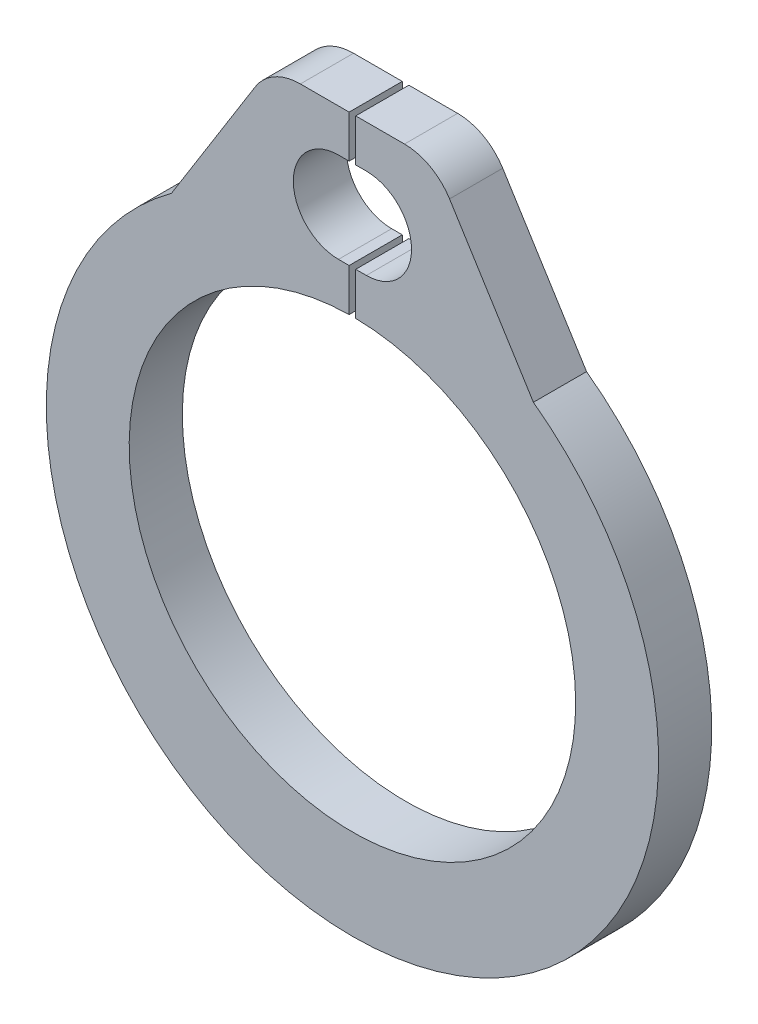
ISO-10303-21;
HEADER;
FILE_DESCRIPTION(('STEP AP214'),'2;1');
FILE_NAME('part.step','',(''),(''),'','','');
FILE_SCHEMA(('AUTOMOTIVE_DESIGN { 1 0 10303 214 1 1 1 1 }'));
ENDSEC;
DATA;
#1=APPLICATION_CONTEXT('core data for automotive mechanical design processes');
#2=APPLICATION_PROTOCOL_DEFINITION('international standard','automotive_design',2000,#1);
#3=PRODUCT_CONTEXT('',#1,'mechanical');
#4=PRODUCT('Part','Part','',(#3));
#5=PRODUCT_RELATED_PRODUCT_CATEGORY('part','',(#4));
#6=PRODUCT_DEFINITION_FORMATION('','',#4);
#7=PRODUCT_DEFINITION_CONTEXT('part definition',#1,'design');
#8=PRODUCT_DEFINITION('design','',#6,#7);
#9=PRODUCT_DEFINITION_SHAPE('','',#8);
#10=(LENGTH_UNIT() NAMED_UNIT(*) SI_UNIT(.MILLI.,.METRE.));
#11=(NAMED_UNIT(*) PLANE_ANGLE_UNIT() SI_UNIT($,.RADIAN.));
#12=(NAMED_UNIT(*) SI_UNIT($,.STERADIAN.) SOLID_ANGLE_UNIT());
#13=UNCERTAINTY_MEASURE_WITH_UNIT(LENGTH_MEASURE(1.E-05),#10,'distance_accuracy_value','');
#14=(GEOMETRIC_REPRESENTATION_CONTEXT(3) GLOBAL_UNCERTAINTY_ASSIGNED_CONTEXT((#13)) GLOBAL_UNIT_ASSIGNED_CONTEXT((#10,
#11,#12)) REPRESENTATION_CONTEXT('',''));
#15=CARTESIAN_POINT('',(0.,0.,0.));
#16=DIRECTION('',(0.,0.,1.));
#17=DIRECTION('',(1.,0.,0.));
#18=AXIS2_PLACEMENT_3D('',#15,#16,#17);
#19=CARTESIAN_POINT('',(-0.325900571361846,-0.0766161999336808,1.));
#20=DIRECTION('',(0.,0.,-1.));
#21=DIRECTION('',(-1.,0.,0.));
#22=AXIS2_PLACEMENT_3D('',#19,#20,#21);
#23=CYLINDRICAL_SURFACE('',#22,4.2);
#24=CARTESIAN_POINT('',(-0.325900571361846,-0.0766161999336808,0.));
#25=DIRECTION('',(0.,0.,1.));
#26=DIRECTION('',(1.,0.,0.));
#27=AXIS2_PLACEMENT_3D('',#24,#25,#26);
#28=CIRCLE('',#27,4.2);
#29=CARTESIAN_POINT('',(-0.387823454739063,4.1229272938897,0.));
#30=VERTEX_POINT('',#29);
#31=CARTESIAN_POINT('',(-0.263977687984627,4.1229272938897,0.));
#32=VERTEX_POINT('',#31);
#33=EDGE_CURVE('E195',#30,#32,#28,.T.);
#34=ORIENTED_EDGE('',*,*,#33,.F.);
#35=DIRECTION('',(0.,0.,-1.));
#36=VECTOR('',#35,1.);
#37=CARTESIAN_POINT('',(-0.387823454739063,4.1229272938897,1.));
#38=LINE('',#37,#36);
#39=CARTESIAN_POINT('',(-0.387823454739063,4.1229272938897,1.));
#40=VERTEX_POINT('',#39);
#41=EDGE_CURVE('E11',#40,#30,#38,.T.);
#42=ORIENTED_EDGE('',*,*,#41,.F.);
#43=CARTESIAN_POINT('',(-0.325900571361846,-0.0766161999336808,1.));
#44=DIRECTION('',(0.,0.,1.));
#45=DIRECTION('',(1.,0.,0.));
#46=AXIS2_PLACEMENT_3D('',#43,#44,#45);
#47=CIRCLE('',#46,4.2);
#48=CARTESIAN_POINT('',(-0.263977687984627,4.1229272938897,1.));
#49=VERTEX_POINT('',#48);
#50=EDGE_CURVE('E239',#40,#49,#47,.T.);
#51=ORIENTED_EDGE('',*,*,#50,.T.);
#52=DIRECTION('',(0.,0.,-1.));
#53=VECTOR('',#52,1.);
#54=CARTESIAN_POINT('',(-0.263977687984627,4.1229272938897,1.));
#55=LINE('',#54,#53);
#56=EDGE_CURVE('E41',#49,#32,#55,.T.);
#57=ORIENTED_EDGE('',*,*,#56,.T.);
#58=EDGE_LOOP('',(#34,#42,#51,#57));
#59=FACE_BOUND('',#58,.T.);
#60=ADVANCED_FACE('F38',(#59),#23,.F.);
#61=CARTESIAN_POINT('',(-0.387823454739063,4.1229272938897,1.));
#62=DIRECTION('',(-1.,0.,0.));
#63=DIRECTION('',(0.,0.,1.));
#64=AXIS2_PLACEMENT_3D('',#61,#62,#63);
#65=PLANE('',#64);
#66=DIRECTION('',(0.,1.,0.));
#67=VECTOR('',#66,1.);
#68=CARTESIAN_POINT('',(-0.387823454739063,4.1229272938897,0.));
#69=LINE('',#68,#67);
#70=CARTESIAN_POINT('',(-0.387823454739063,4.92338380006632,0.));
#71=VERTEX_POINT('',#70);
#72=EDGE_CURVE('E238',#30,#71,#69,.T.);
#73=ORIENTED_EDGE('',*,*,#72,.T.);
#74=DIRECTION('',(0.,0.,-1.));
#75=VECTOR('',#74,1.);
#76=CARTESIAN_POINT('',(-0.387823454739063,4.92338380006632,1.));
#77=LINE('',#76,#75);
#78=CARTESIAN_POINT('',(-0.387823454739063,4.92338380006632,1.));
#79=VERTEX_POINT('',#78);
#80=EDGE_CURVE('E47',#79,#71,#77,.T.);
#81=ORIENTED_EDGE('',*,*,#80,.F.);
#82=DIRECTION('',(0.,1.,0.));
#83=VECTOR('',#82,1.);
#84=CARTESIAN_POINT('',(-0.387823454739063,4.1229272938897,1.));
#85=LINE('',#84,#83);
#86=EDGE_CURVE('E184',#40,#79,#85,.T.);
#87=ORIENTED_EDGE('',*,*,#86,.F.);
#88=ORIENTED_EDGE('',*,*,#41,.T.);
#89=EDGE_LOOP('',(#73,#81,#87,#88));
#90=FACE_BOUND('',#89,.T.);
#91=ADVANCED_FACE('F276',(#90),#65,.F.);
#92=CARTESIAN_POINT('',(-0.587823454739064,4.92338380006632,1.));
#93=DIRECTION('',(0.,1.,0.));
#94=DIRECTION('',(0.,0.,1.));
#95=AXIS2_PLACEMENT_3D('',#92,#93,#94);
#96=PLANE('',#95);
#97=DIRECTION('',(1.,0.,0.));
#98=VECTOR('',#97,1.);
#99=CARTESIAN_POINT('',(-0.587823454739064,4.92338380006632,0.));
#100=LINE('',#99,#98);
#101=CARTESIAN_POINT('',(-0.587823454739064,4.92338380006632,0.));
#102=VERTEX_POINT('',#101);
#103=EDGE_CURVE('E172',#102,#71,#100,.T.);
#104=ORIENTED_EDGE('',*,*,#103,.F.);
#105=DIRECTION('',(0.,0.,-1.));
#106=VECTOR('',#105,1.);
#107=CARTESIAN_POINT('',(-0.587823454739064,4.92338380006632,1.));
#108=LINE('',#107,#106);
#109=CARTESIAN_POINT('',(-0.587823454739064,4.92338380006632,1.));
#110=VERTEX_POINT('',#109);
#111=EDGE_CURVE('E167',#110,#102,#108,.T.);
#112=ORIENTED_EDGE('',*,*,#111,.F.);
#113=DIRECTION('',(1.,0.,0.));
#114=VECTOR('',#113,1.);
#115=CARTESIAN_POINT('',(-0.587823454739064,4.92338380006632,1.));
#116=LINE('',#115,#114);
#117=EDGE_CURVE('E170',#110,#79,#116,.T.);
#118=ORIENTED_EDGE('',*,*,#117,.T.);
#119=ORIENTED_EDGE('',*,*,#80,.T.);
#120=EDGE_LOOP('',(#104,#112,#118,#119));
#121=FACE_BOUND('',#120,.T.);
#122=ADVANCED_FACE('F169',(#121),#96,.T.);
#123=CARTESIAN_POINT('',(-0.587823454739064,5.77338380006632,1.));
#124=DIRECTION('',(0.,0.,-1.));
#125=DIRECTION('',(-1.,0.,0.));
#126=AXIS2_PLACEMENT_3D('',#123,#124,#125);
#127=CYLINDRICAL_SURFACE('',#126,0.85);
#128=CARTESIAN_POINT('',(-0.587823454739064,5.77338380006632,0.));
#129=DIRECTION('',(0.,0.,1.));
#130=DIRECTION('',(1.,0.,0.));
#131=AXIS2_PLACEMENT_3D('',#128,#129,#130);
#132=CIRCLE('',#131,0.85);
#133=CARTESIAN_POINT('',(-0.587823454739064,6.62338380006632,0.));
#134=VERTEX_POINT('',#133);
#135=EDGE_CURVE('E235',#134,#102,#132,.T.);
#136=ORIENTED_EDGE('',*,*,#135,.F.);
#137=DIRECTION('',(0.,0.,-1.));
#138=VECTOR('',#137,1.);
#139=CARTESIAN_POINT('',(-0.587823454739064,6.62338380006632,1.));
#140=LINE('',#139,#138);
#141=CARTESIAN_POINT('',(-0.587823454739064,6.62338380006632,1.));
#142=VERTEX_POINT('',#141);
#143=EDGE_CURVE('E177',#142,#134,#140,.T.);
#144=ORIENTED_EDGE('',*,*,#143,.F.);
#145=CARTESIAN_POINT('',(-0.587823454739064,5.77338380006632,1.));
#146=DIRECTION('',(0.,0.,1.));
#147=DIRECTION('',(1.,0.,0.));
#148=AXIS2_PLACEMENT_3D('',#145,#146,#147);
#149=CIRCLE('',#148,0.85);
#150=EDGE_CURVE('E183',#142,#110,#149,.T.);
#151=ORIENTED_EDGE('',*,*,#150,.T.);
#152=ORIENTED_EDGE('',*,*,#111,.T.);
#153=EDGE_LOOP('',(#136,#144,#151,#152));
#154=FACE_BOUND('',#153,.T.);
#155=ADVANCED_FACE('F186',(#154),#127,.F.);
#156=CARTESIAN_POINT('',(-0.587823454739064,6.62338380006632,1.));
#157=DIRECTION('',(0.,1.,0.));
#158=DIRECTION('',(0.,0.,1.));
#159=AXIS2_PLACEMENT_3D('',#156,#157,#158);
#160=PLANE('',#159);
#161=DIRECTION('',(1.,0.,0.));
#162=VECTOR('',#161,1.);
#163=CARTESIAN_POINT('',(-0.587823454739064,6.62338380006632,0.));
#164=LINE('',#163,#162);
#165=CARTESIAN_POINT('',(-0.387823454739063,6.62338380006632,0.));
#166=VERTEX_POINT('',#165);
#167=EDGE_CURVE('E233',#134,#166,#164,.T.);
#168=ORIENTED_EDGE('',*,*,#167,.T.);
#169=DIRECTION('',(0.,0.,-1.));
#170=VECTOR('',#169,1.);
#171=CARTESIAN_POINT('',(-0.387823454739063,6.62338380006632,1.));
#172=LINE('',#171,#170);
#173=CARTESIAN_POINT('',(-0.387823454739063,6.62338380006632,1.));
#174=VERTEX_POINT('',#173);
#175=EDGE_CURVE('E243',#174,#166,#172,.T.);
#176=ORIENTED_EDGE('',*,*,#175,.F.);
#177=DIRECTION('',(1.,0.,0.));
#178=VECTOR('',#177,1.);
#179=CARTESIAN_POINT('',(-0.587823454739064,6.62338380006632,1.));
#180=LINE('',#179,#178);
#181=EDGE_CURVE('E188',#142,#174,#180,.T.);
#182=ORIENTED_EDGE('',*,*,#181,.F.);
#183=ORIENTED_EDGE('',*,*,#143,.T.);
#184=EDGE_LOOP('',(#168,#176,#182,#183));
#185=FACE_BOUND('',#184,.T.);
#186=ADVANCED_FACE('F364',(#185),#160,.F.);
#187=CARTESIAN_POINT('',(-0.387823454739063,6.62338380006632,1.));
#188=DIRECTION('',(-1.,0.,0.));
#189=DIRECTION('',(0.,0.,1.));
#190=AXIS2_PLACEMENT_3D('',#187,#188,#189);
#191=PLANE('',#190);
#192=DIRECTION('',(0.,1.,0.));
#193=VECTOR('',#192,1.);
#194=CARTESIAN_POINT('',(-0.387823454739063,6.62338380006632,0.));
#195=LINE('',#194,#193);
#196=CARTESIAN_POINT('',(-0.387823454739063,7.4229272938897,0.));
#197=VERTEX_POINT('',#196);
#198=EDGE_CURVE('E230',#166,#197,#195,.T.);
#199=ORIENTED_EDGE('',*,*,#198,.T.);
#200=DIRECTION('',(0.,0.,-1.));
#201=VECTOR('',#200,1.);
#202=CARTESIAN_POINT('',(-0.387823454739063,7.4229272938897,1.));
#203=LINE('',#202,#201);
#204=CARTESIAN_POINT('',(-0.387823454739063,7.4229272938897,1.));
#205=VERTEX_POINT('',#204);
#206=EDGE_CURVE('E246',#205,#197,#203,.T.);
#207=ORIENTED_EDGE('',*,*,#206,.F.);
#208=DIRECTION('',(0.,1.,0.));
#209=VECTOR('',#208,1.);
#210=CARTESIAN_POINT('',(-0.387823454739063,6.62338380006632,1.));
#211=LINE('',#210,#209);
#212=EDGE_CURVE('E190',#174,#205,#211,.T.);
#213=ORIENTED_EDGE('',*,*,#212,.F.);
#214=ORIENTED_EDGE('',*,*,#175,.T.);
#215=EDGE_LOOP('',(#199,#207,#213,#214));
#216=FACE_BOUND('',#215,.T.);
#217=ADVANCED_FACE('F312',(#216),#191,.F.);
#218=CARTESIAN_POINT('',(-1.30524120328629,7.4229272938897,1.));
#219=DIRECTION('',(0.,1.,0.));
#220=DIRECTION('',(0.,0.,1.));
#221=AXIS2_PLACEMENT_3D('',#218,#219,#220);
#222=PLANE('',#221);
#223=DIRECTION('',(1.,0.,0.));
#224=VECTOR('',#223,1.);
#225=CARTESIAN_POINT('',(-1.30524120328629,7.4229272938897,0.));
#226=LINE('',#225,#224);
#227=CARTESIAN_POINT('',(-1.30524120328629,7.4229272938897,0.));
#228=VERTEX_POINT('',#227);
#229=EDGE_CURVE('E227',#228,#197,#226,.T.);
#230=ORIENTED_EDGE('',*,*,#229,.F.);
#231=DIRECTION('',(0.,0.,-1.));
#232=VECTOR('',#231,1.);
#233=CARTESIAN_POINT('',(-1.30524120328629,7.4229272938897,1.));
#234=LINE('',#233,#232);
#235=CARTESIAN_POINT('',(-1.30524120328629,7.4229272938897,1.));
#236=VERTEX_POINT('',#235);
#237=EDGE_CURVE('E248',#236,#228,#234,.T.);
#238=ORIENTED_EDGE('',*,*,#237,.F.);
#239=DIRECTION('',(1.,0.,0.));
#240=VECTOR('',#239,1.);
#241=CARTESIAN_POINT('',(-1.30524120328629,7.4229272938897,1.));
#242=LINE('',#241,#240);
#243=EDGE_CURVE('E305',#236,#205,#242,.T.);
#244=ORIENTED_EDGE('',*,*,#243,.T.);
#245=ORIENTED_EDGE('',*,*,#206,.T.);
#246=EDGE_LOOP('',(#230,#238,#244,#245));
#247=FACE_BOUND('',#246,.T.);
#248=ADVANCED_FACE('F316',(#247),#222,.T.);
#249=CARTESIAN_POINT('',(-1.3052412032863,6.4229272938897,1.));
#250=DIRECTION('',(0.,0.,-1.));
#251=DIRECTION('',(-1.,0.,0.));
#252=AXIS2_PLACEMENT_3D('',#249,#250,#251);
#253=CYLINDRICAL_SURFACE('',#252,1.);
#254=CARTESIAN_POINT('',(-1.3052412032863,6.4229272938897,0.));
#255=DIRECTION('',(0.,0.,1.));
#256=DIRECTION('',(1.,0.,0.));
#257=AXIS2_PLACEMENT_3D('',#254,#255,#256);
#258=CIRCLE('',#257,1.);
#259=CARTESIAN_POINT('',(-2.15328929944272,6.9528465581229,0.));
#260=VERTEX_POINT('',#259);
#261=EDGE_CURVE('E224',#228,#260,#258,.T.);
#262=ORIENTED_EDGE('',*,*,#261,.T.);
#263=DIRECTION('',(0.,0.,-1.));
#264=VECTOR('',#263,1.);
#265=CARTESIAN_POINT('',(-2.15328929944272,6.9528465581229,1.));
#266=LINE('',#265,#264);
#267=CARTESIAN_POINT('',(-2.15328929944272,6.9528465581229,1.));
#268=VERTEX_POINT('',#267);
#269=EDGE_CURVE('E250',#268,#260,#266,.T.);
#270=ORIENTED_EDGE('',*,*,#269,.F.);
#271=CARTESIAN_POINT('',(-1.3052412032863,6.4229272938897,1.));
#272=DIRECTION('',(0.,0.,1.));
#273=DIRECTION('',(1.,0.,0.));
#274=AXIS2_PLACEMENT_3D('',#271,#272,#273);
#275=CIRCLE('',#274,1.);
#276=EDGE_CURVE('E303',#236,#268,#275,.T.);
#277=ORIENTED_EDGE('',*,*,#276,.F.);
#278=ORIENTED_EDGE('',*,*,#237,.T.);
#279=EDGE_LOOP('',(#262,#270,#277,#278));
#280=FACE_BOUND('',#279,.T.);
#281=ADVANCED_FACE('F321',(#280),#253,.T.);
#282=CARTESIAN_POINT('',(-3.7309841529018,4.42800700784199,1.));
#283=DIRECTION('',(-0.848048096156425,0.529919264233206,0.));
#284=DIRECTION('',(-0.529919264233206,-0.848048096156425,0.));
#285=AXIS2_PLACEMENT_3D('',#282,#283,#284);
#286=PLANE('',#285);
#287=DIRECTION('',(0.529919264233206,0.848048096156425,0.));
#288=VECTOR('',#287,1.);
#289=CARTESIAN_POINT('',(-3.7309841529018,4.42800700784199,0.));
#290=LINE('',#289,#288);
#291=CARTESIAN_POINT('',(-3.7309841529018,4.42800700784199,0.));
#292=VERTEX_POINT('',#291);
#293=EDGE_CURVE('E221',#292,#260,#290,.T.);
#294=ORIENTED_EDGE('',*,*,#293,.F.);
#295=DIRECTION('',(0.,0.,-1.));
#296=VECTOR('',#295,1.);
#297=CARTESIAN_POINT('',(-3.7309841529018,4.42800700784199,1.));
#298=LINE('',#297,#296);
#299=CARTESIAN_POINT('',(-3.7309841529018,4.42800700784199,1.));
#300=VERTEX_POINT('',#299);
#301=EDGE_CURVE('E252',#300,#292,#298,.T.);
#302=ORIENTED_EDGE('',*,*,#301,.F.);
#303=DIRECTION('',(0.529919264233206,0.848048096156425,0.));
#304=VECTOR('',#303,1.);
#305=CARTESIAN_POINT('',(-3.7309841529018,4.42800700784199,1.));
#306=LINE('',#305,#304);
#307=EDGE_CURVE('E300',#300,#268,#306,.T.);
#308=ORIENTED_EDGE('',*,*,#307,.T.);
#309=ORIENTED_EDGE('',*,*,#269,.T.);
#310=EDGE_LOOP('',(#294,#302,#308,#309));
#311=FACE_BOUND('',#310,.T.);
#312=ADVANCED_FACE('F327',(#311),#286,.T.);
#313=CARTESIAN_POINT('',(-0.325900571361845,-0.217119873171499,1.));
#314=DIRECTION('',(0.,0.,-1.));
#315=DIRECTION('',(-1.,0.,0.));
#316=AXIS2_PLACEMENT_3D('',#313,#314,#315);
#317=CYLINDRICAL_SURFACE('',#316,5.75949632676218);
#318=CARTESIAN_POINT('',(-0.325900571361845,-0.217119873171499,0.));
#319=DIRECTION('',(0.,0.,1.));
#320=DIRECTION('',(1.,0.,0.));
#321=AXIS2_PLACEMENT_3D('',#318,#319,#320);
#322=CIRCLE('',#321,5.75949632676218);
#323=CARTESIAN_POINT('',(3.07918301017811,4.42800700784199,0.));
#324=VERTEX_POINT('',#323);
#325=EDGE_CURVE('E219',#292,#324,#322,.T.);
#326=ORIENTED_EDGE('',*,*,#325,.T.);
#327=DIRECTION('',(0.,0.,-1.));
#328=VECTOR('',#327,1.);
#329=CARTESIAN_POINT('',(3.07918301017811,4.42800700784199,1.));
#330=LINE('',#329,#328);
#331=CARTESIAN_POINT('',(3.07918301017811,4.42800700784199,1.));
#332=VERTEX_POINT('',#331);
#333=EDGE_CURVE('E254',#332,#324,#330,.T.);
#334=ORIENTED_EDGE('',*,*,#333,.F.);
#335=CARTESIAN_POINT('',(-0.325900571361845,-0.217119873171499,1.));
#336=DIRECTION('',(0.,0.,1.));
#337=DIRECTION('',(1.,0.,0.));
#338=AXIS2_PLACEMENT_3D('',#335,#336,#337);
#339=CIRCLE('',#338,5.75949632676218);
#340=EDGE_CURVE('E298',#300,#332,#339,.T.);
#341=ORIENTED_EDGE('',*,*,#340,.F.);
#342=ORIENTED_EDGE('',*,*,#301,.T.);
#343=EDGE_LOOP('',(#326,#334,#341,#342));
#344=FACE_BOUND('',#343,.T.);
#345=ADVANCED_FACE('F330',(#344),#317,.T.);
#346=CARTESIAN_POINT('',(3.07918301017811,4.42800700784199,1.));
#347=DIRECTION('',(-0.848048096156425,-0.529919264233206,0.));
#348=DIRECTION('',(0.529919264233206,-0.848048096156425,0.));
#349=AXIS2_PLACEMENT_3D('',#346,#347,#348);
#350=PLANE('',#349);
#351=DIRECTION('',(-0.529919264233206,0.848048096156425,0.));
#352=VECTOR('',#351,1.);
#353=CARTESIAN_POINT('',(3.07918301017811,4.42800700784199,0.));
#354=LINE('',#353,#352);
#355=CARTESIAN_POINT('',(1.50148815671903,6.9528465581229,0.));
#356=VERTEX_POINT('',#355);
#357=EDGE_CURVE('E217',#324,#356,#354,.T.);
#358=ORIENTED_EDGE('',*,*,#357,.T.);
#359=DIRECTION('',(0.,0.,-1.));
#360=VECTOR('',#359,1.);
#361=CARTESIAN_POINT('',(1.50148815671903,6.9528465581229,1.));
#362=LINE('',#361,#360);
#363=CARTESIAN_POINT('',(1.50148815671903,6.9528465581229,1.));
#364=VERTEX_POINT('',#363);
#365=EDGE_CURVE('E257',#364,#356,#362,.T.);
#366=ORIENTED_EDGE('',*,*,#365,.F.);
#367=DIRECTION('',(-0.529919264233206,0.848048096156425,0.));
#368=VECTOR('',#367,1.);
#369=CARTESIAN_POINT('',(3.07918301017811,4.42800700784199,1.));
#370=LINE('',#369,#368);
#371=EDGE_CURVE('E296',#332,#364,#370,.T.);
#372=ORIENTED_EDGE('',*,*,#371,.F.);
#373=ORIENTED_EDGE('',*,*,#333,.T.);
#374=EDGE_LOOP('',(#358,#366,#372,#373));
#375=FACE_BOUND('',#374,.T.);
#376=ADVANCED_FACE('F335',(#375),#350,.F.);
#377=CARTESIAN_POINT('',(0.653440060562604,6.4229272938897,1.));
#378=DIRECTION('',(0.,0.,-1.));
#379=DIRECTION('',(-1.,0.,0.));
#380=AXIS2_PLACEMENT_3D('',#377,#378,#379);
#381=CYLINDRICAL_SURFACE('',#380,1.);
#382=CARTESIAN_POINT('',(0.653440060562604,6.4229272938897,0.));
#383=DIRECTION('',(0.,0.,1.));
#384=DIRECTION('',(1.,0.,0.));
#385=AXIS2_PLACEMENT_3D('',#382,#383,#384);
#386=CIRCLE('',#385,1.);
#387=CARTESIAN_POINT('',(0.6534400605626,7.4229272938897,0.));
#388=VERTEX_POINT('',#387);
#389=EDGE_CURVE('E215',#356,#388,#386,.T.);
#390=ORIENTED_EDGE('',*,*,#389,.T.);
#391=DIRECTION('',(0.,0.,-1.));
#392=VECTOR('',#391,1.);
#393=CARTESIAN_POINT('',(0.6534400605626,7.4229272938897,1.));
#394=LINE('',#393,#392);
#395=CARTESIAN_POINT('',(0.6534400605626,7.4229272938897,1.));
#396=VERTEX_POINT('',#395);
#397=EDGE_CURVE('E260',#396,#388,#394,.T.);
#398=ORIENTED_EDGE('',*,*,#397,.F.);
#399=CARTESIAN_POINT('',(0.653440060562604,6.4229272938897,1.));
#400=DIRECTION('',(0.,0.,1.));
#401=DIRECTION('',(1.,0.,0.));
#402=AXIS2_PLACEMENT_3D('',#399,#400,#401);
#403=CIRCLE('',#402,1.);
#404=EDGE_CURVE('E294',#364,#396,#403,.T.);
#405=ORIENTED_EDGE('',*,*,#404,.F.);
#406=ORIENTED_EDGE('',*,*,#365,.T.);
#407=EDGE_LOOP('',(#390,#398,#405,#406));
#408=FACE_BOUND('',#407,.T.);
#409=ADVANCED_FACE('F342',(#408),#381,.T.);
#410=CARTESIAN_POINT('',(0.6534400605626,7.4229272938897,1.));
#411=DIRECTION('',(0.,-1.,0.));
#412=DIRECTION('',(0.,0.,-1.));
#413=AXIS2_PLACEMENT_3D('',#410,#411,#412);
#414=PLANE('',#413);
#415=DIRECTION('',(-1.,0.,0.));
#416=VECTOR('',#415,1.);
#417=CARTESIAN_POINT('',(0.6534400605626,7.4229272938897,0.));
#418=LINE('',#417,#416);
#419=CARTESIAN_POINT('',(-0.263977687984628,7.4229272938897,0.));
#420=VERTEX_POINT('',#419);
#421=EDGE_CURVE('E212',#388,#420,#418,.T.);
#422=ORIENTED_EDGE('',*,*,#421,.T.);
#423=DIRECTION('',(0.,0.,-1.));
#424=VECTOR('',#423,1.);
#425=CARTESIAN_POINT('',(-0.263977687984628,7.4229272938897,1.));
#426=LINE('',#425,#424);
#427=CARTESIAN_POINT('',(-0.263977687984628,7.4229272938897,1.));
#428=VERTEX_POINT('',#427);
#429=EDGE_CURVE('E263',#428,#420,#426,.T.);
#430=ORIENTED_EDGE('',*,*,#429,.F.);
#431=DIRECTION('',(-1.,0.,0.));
#432=VECTOR('',#431,1.);
#433=CARTESIAN_POINT('',(0.6534400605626,7.4229272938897,1.));
#434=LINE('',#433,#432);
#435=EDGE_CURVE('E292',#396,#428,#434,.T.);
#436=ORIENTED_EDGE('',*,*,#435,.F.);
#437=ORIENTED_EDGE('',*,*,#397,.T.);
#438=EDGE_LOOP('',(#422,#430,#436,#437));
#439=FACE_BOUND('',#438,.T.);
#440=ADVANCED_FACE('F346',(#439),#414,.F.);
#441=CARTESIAN_POINT('',(-0.26397768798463,6.62338380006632,1.));
#442=DIRECTION('',(-1.,0.,0.));
#443=DIRECTION('',(0.,-1.,0.));
#444=AXIS2_PLACEMENT_3D('',#441,#442,#443);
#445=PLANE('',#444);
#446=DIRECTION('',(0.,1.,0.));
#447=VECTOR('',#446,1.);
#448=CARTESIAN_POINT('',(-0.26397768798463,6.62338380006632,0.));
#449=LINE('',#448,#447);
#450=CARTESIAN_POINT('',(-0.26397768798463,6.62338380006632,0.));
#451=VERTEX_POINT('',#450);
#452=EDGE_CURVE('E209',#451,#420,#449,.T.);
#453=ORIENTED_EDGE('',*,*,#452,.F.);
#454=DIRECTION('',(0.,0.,-1.));
#455=VECTOR('',#454,1.);
#456=CARTESIAN_POINT('',(-0.26397768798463,6.62338380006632,1.));
#457=LINE('',#456,#455);
#458=CARTESIAN_POINT('',(-0.26397768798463,6.62338380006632,1.));
#459=VERTEX_POINT('',#458);
#460=EDGE_CURVE('E265',#459,#451,#457,.T.);
#461=ORIENTED_EDGE('',*,*,#460,.F.);
#462=DIRECTION('',(0.,1.,0.));
#463=VECTOR('',#462,1.);
#464=CARTESIAN_POINT('',(-0.26397768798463,6.62338380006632,1.));
#465=LINE('',#464,#463);
#466=EDGE_CURVE('E289',#459,#428,#465,.T.);
#467=ORIENTED_EDGE('',*,*,#466,.T.);
#468=ORIENTED_EDGE('',*,*,#429,.T.);
#469=EDGE_LOOP('',(#453,#461,#467,#468));
#470=FACE_BOUND('',#469,.T.);
#471=ADVANCED_FACE('F349',(#470),#445,.T.);
#472=CARTESIAN_POINT('',(-0.26397768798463,6.62338380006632,1.));
#473=DIRECTION('',(0.,1.,0.));
#474=DIRECTION('',(0.,0.,1.));
#475=AXIS2_PLACEMENT_3D('',#472,#473,#474);
#476=PLANE('',#475);
#477=DIRECTION('',(1.,0.,0.));
#478=VECTOR('',#477,1.);
#479=CARTESIAN_POINT('',(-0.26397768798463,6.62338380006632,0.));
#480=LINE('',#479,#478);
#481=CARTESIAN_POINT('',(-0.0639776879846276,6.62338380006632,0.));
#482=VERTEX_POINT('',#481);
#483=EDGE_CURVE('E207',#451,#482,#480,.T.);
#484=ORIENTED_EDGE('',*,*,#483,.T.);
#485=DIRECTION('',(0.,0.,-1.));
#486=VECTOR('',#485,1.);
#487=CARTESIAN_POINT('',(-0.0639776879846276,6.62338380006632,1.));
#488=LINE('',#487,#486);
#489=CARTESIAN_POINT('',(-0.0639776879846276,6.62338380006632,1.));
#490=VERTEX_POINT('',#489);
#491=EDGE_CURVE('E267',#490,#482,#488,.T.);
#492=ORIENTED_EDGE('',*,*,#491,.F.);
#493=DIRECTION('',(1.,0.,0.));
#494=VECTOR('',#493,1.);
#495=CARTESIAN_POINT('',(-0.26397768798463,6.62338380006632,1.));
#496=LINE('',#495,#494);
#497=EDGE_CURVE('E287',#459,#490,#496,.T.);
#498=ORIENTED_EDGE('',*,*,#497,.F.);
#499=ORIENTED_EDGE('',*,*,#460,.T.);
#500=EDGE_LOOP('',(#484,#492,#498,#499));
#501=FACE_BOUND('',#500,.T.);
#502=ADVANCED_FACE('F355',(#501),#476,.F.);
#503=CARTESIAN_POINT('',(-0.0639776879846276,5.77338380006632,1.));
#504=DIRECTION('',(0.,0.,-1.));
#505=DIRECTION('',(-1.,0.,0.));
#506=AXIS2_PLACEMENT_3D('',#503,#504,#505);
#507=CYLINDRICAL_SURFACE('',#506,0.85);
#508=CARTESIAN_POINT('',(-0.0639776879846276,5.77338380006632,0.));
#509=DIRECTION('',(0.,0.,-1.));
#510=DIRECTION('',(-1.,0.,0.));
#511=AXIS2_PLACEMENT_3D('',#508,#509,#510);
#512=CIRCLE('',#511,0.85);
#513=CARTESIAN_POINT('',(-0.0639776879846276,4.92338380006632,0.));
#514=VERTEX_POINT('',#513);
#515=EDGE_CURVE('E204',#482,#514,#512,.T.);
#516=ORIENTED_EDGE('',*,*,#515,.T.);
#517=DIRECTION('',(0.,0.,-1.));
#518=VECTOR('',#517,1.);
#519=CARTESIAN_POINT('',(-0.0639776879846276,4.92338380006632,1.));
#520=LINE('',#519,#518);
#521=CARTESIAN_POINT('',(-0.0639776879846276,4.92338380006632,1.));
#522=VERTEX_POINT('',#521);
#523=EDGE_CURVE('E270',#522,#514,#520,.T.);
#524=ORIENTED_EDGE('',*,*,#523,.F.);
#525=CARTESIAN_POINT('',(-0.0639776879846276,5.77338380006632,1.));
#526=DIRECTION('',(0.,0.,-1.));
#527=DIRECTION('',(-1.,0.,0.));
#528=AXIS2_PLACEMENT_3D('',#525,#526,#527);
#529=CIRCLE('',#528,0.85);
#530=EDGE_CURVE('E285',#490,#522,#529,.T.);
#531=ORIENTED_EDGE('',*,*,#530,.F.);
#532=ORIENTED_EDGE('',*,*,#491,.T.);
#533=EDGE_LOOP('',(#516,#524,#531,#532));
#534=FACE_BOUND('',#533,.T.);
#535=ADVANCED_FACE('F359',(#534),#507,.F.);
#536=CARTESIAN_POINT('',(-0.263977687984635,4.92338380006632,1.));
#537=DIRECTION('',(0.,1.,0.));
#538=DIRECTION('',(0.,0.,1.));
#539=AXIS2_PLACEMENT_3D('',#536,#537,#538);
#540=PLANE('',#539);
#541=DIRECTION('',(1.,0.,0.));
#542=VECTOR('',#541,1.);
#543=CARTESIAN_POINT('',(-0.263977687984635,4.92338380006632,0.));
#544=LINE('',#543,#542);
#545=CARTESIAN_POINT('',(-0.263977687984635,4.92338380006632,0.));
#546=VERTEX_POINT('',#545);
#547=EDGE_CURVE('E201',#546,#514,#544,.T.);
#548=ORIENTED_EDGE('',*,*,#547,.F.);
#549=DIRECTION('',(0.,0.,-1.));
#550=VECTOR('',#549,1.);
#551=CARTESIAN_POINT('',(-0.263977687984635,4.92338380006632,1.));
#552=LINE('',#551,#550);
#553=CARTESIAN_POINT('',(-0.263977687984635,4.92338380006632,1.));
#554=VERTEX_POINT('',#553);
#555=EDGE_CURVE('E271',#554,#546,#552,.T.);
#556=ORIENTED_EDGE('',*,*,#555,.F.);
#557=DIRECTION('',(1.,0.,0.));
#558=VECTOR('',#557,1.);
#559=CARTESIAN_POINT('',(-0.263977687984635,4.92338380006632,1.));
#560=LINE('',#559,#558);
#561=EDGE_CURVE('E280',#554,#522,#560,.T.);
#562=ORIENTED_EDGE('',*,*,#561,.T.);
#563=ORIENTED_EDGE('',*,*,#523,.T.);
#564=EDGE_LOOP('',(#548,#556,#562,#563));
#565=FACE_BOUND('',#564,.T.);
#566=ADVANCED_FACE('F361',(#565),#540,.T.);
#567=CARTESIAN_POINT('',(-0.263977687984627,4.1229272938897,1.));
#568=DIRECTION('',(-1.,0.,0.));
#569=DIRECTION('',(0.,-1.,0.));
#570=AXIS2_PLACEMENT_3D('',#567,#568,#569);
#571=PLANE('',#570);
#572=DIRECTION('',(0.,1.,0.));
#573=VECTOR('',#572,1.);
#574=CARTESIAN_POINT('',(-0.263977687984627,4.1229272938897,0.));
#575=LINE('',#574,#573);
#576=EDGE_CURVE('E198',#32,#546,#575,.T.);
#577=ORIENTED_EDGE('',*,*,#576,.F.);
#578=ORIENTED_EDGE('',*,*,#56,.F.);
#579=DIRECTION('',(0.,1.,0.));
#580=VECTOR('',#579,1.);
#581=CARTESIAN_POINT('',(-0.263977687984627,4.1229272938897,1.));
#582=LINE('',#581,#580);
#583=EDGE_CURVE('E278',#49,#554,#582,.T.);
#584=ORIENTED_EDGE('',*,*,#583,.T.);
#585=ORIENTED_EDGE('',*,*,#555,.T.);
#586=EDGE_LOOP('',(#577,#578,#584,#585));
#587=FACE_BOUND('',#586,.T.);
#588=ADVANCED_FACE('F273',(#587),#571,.T.);
#589=CARTESIAN_POINT('',(-0.325900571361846,-0.0766161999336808,1.));
#590=DIRECTION('',(0.,0.,1.));
#591=DIRECTION('',(1.,0.,0.));
#592=AXIS2_PLACEMENT_3D('',#589,#590,#591);
#593=PLANE('',#592);
#594=ORIENTED_EDGE('',*,*,#50,.F.);
#595=ORIENTED_EDGE('',*,*,#86,.T.);
#596=ORIENTED_EDGE('',*,*,#117,.F.);
#597=ORIENTED_EDGE('',*,*,#150,.F.);
#598=ORIENTED_EDGE('',*,*,#181,.T.);
#599=ORIENTED_EDGE('',*,*,#212,.T.);
#600=ORIENTED_EDGE('',*,*,#243,.F.);
#601=ORIENTED_EDGE('',*,*,#276,.T.);
#602=ORIENTED_EDGE('',*,*,#307,.F.);
#603=ORIENTED_EDGE('',*,*,#340,.T.);
#604=ORIENTED_EDGE('',*,*,#371,.T.);
#605=ORIENTED_EDGE('',*,*,#404,.T.);
#606=ORIENTED_EDGE('',*,*,#435,.T.);
#607=ORIENTED_EDGE('',*,*,#466,.F.);
#608=ORIENTED_EDGE('',*,*,#497,.T.);
#609=ORIENTED_EDGE('',*,*,#530,.T.);
#610=ORIENTED_EDGE('',*,*,#561,.F.);
#611=ORIENTED_EDGE('',*,*,#583,.F.);
#612=EDGE_LOOP('',(#594,#595,#596,#597,#598,#599,#600,#601,#602,#603,#604,#605,#606,#607,#608,
#609,#610,#611));
#613=FACE_BOUND('',#612,.T.);
#614=ADVANCED_FACE('F182',(#613),#593,.T.);
#615=CARTESIAN_POINT('',(-0.325900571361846,-0.0766161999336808,0.));
#616=DIRECTION('',(0.,0.,1.));
#617=DIRECTION('',(1.,0.,0.));
#618=AXIS2_PLACEMENT_3D('',#615,#616,#617);
#619=PLANE('',#618);
#620=ORIENTED_EDGE('',*,*,#33,.T.);
#621=ORIENTED_EDGE('',*,*,#576,.T.);
#622=ORIENTED_EDGE('',*,*,#547,.T.);
#623=ORIENTED_EDGE('',*,*,#515,.F.);
#624=ORIENTED_EDGE('',*,*,#483,.F.);
#625=ORIENTED_EDGE('',*,*,#452,.T.);
#626=ORIENTED_EDGE('',*,*,#421,.F.);
#627=ORIENTED_EDGE('',*,*,#389,.F.);
#628=ORIENTED_EDGE('',*,*,#357,.F.);
#629=ORIENTED_EDGE('',*,*,#325,.F.);
#630=ORIENTED_EDGE('',*,*,#293,.T.);
#631=ORIENTED_EDGE('',*,*,#261,.F.);
#632=ORIENTED_EDGE('',*,*,#229,.T.);
#633=ORIENTED_EDGE('',*,*,#198,.F.);
#634=ORIENTED_EDGE('',*,*,#167,.F.);
#635=ORIENTED_EDGE('',*,*,#135,.T.);
#636=ORIENTED_EDGE('',*,*,#103,.T.);
#637=ORIENTED_EDGE('',*,*,#72,.F.);
#638=EDGE_LOOP('',(#620,#621,#622,#623,#624,#625,#626,#627,#628,#629,#630,#631,#632,#633,#634,
#635,#636,#637));
#639=FACE_BOUND('',#638,.T.);
#640=ADVANCED_FACE('F275',(#639),#619,.F.);
#641=CLOSED_SHELL('',(#60,#91,#122,#155,#186,#217,#248,#281,#312,#345,#376,#409,#440,#471,#502,
#535,#566,#588,#614,#640));
#642=MANIFOLD_SOLID_BREP('B2',#641);
#643=ADVANCED_BREP_SHAPE_REPRESENTATION('',(#18,#642),#14);
#644=SHAPE_DEFINITION_REPRESENTATION(#9,#643);
ENDSEC;
END-ISO-10303-21;
